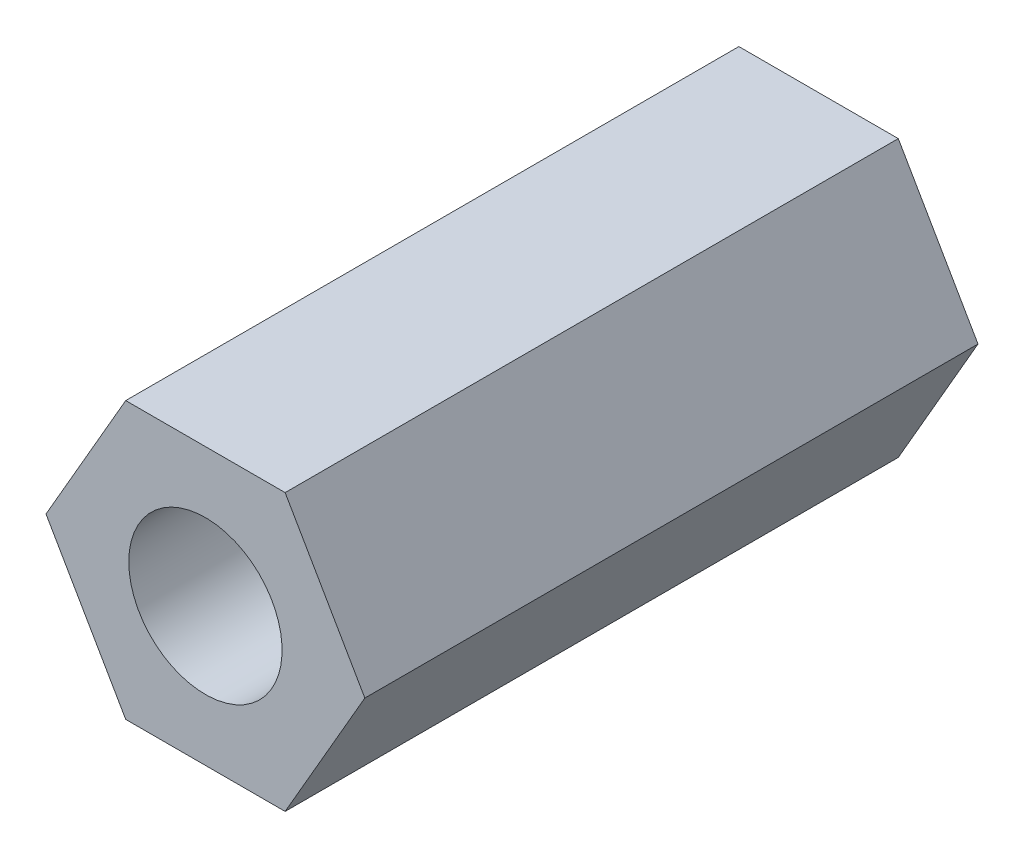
from build123d import *

# Parameters (mm, degrees)
EXTRUDE_1_DEPTH    = 10
HOLE_WIZARD_M3_1_D = 2.5


with BuildPart() as part:
    # Sketch 1 → Extrude 1 (new body)
    with BuildSketch(Plane.XY):
        Polygon((2.6, 0), (1.3, 2.25166605), (-1.3, 2.25166605), (-2.6, 0), (-1.3, -2.25166605), (1.3, -2.25166605), align=None)
    extrude(amount=EXTRUDE_1_DEPTH)

    # Hole Wizard M3 _1 (through all)
    with Locations(Plane(origin=(0, 0, 0), x_dir=(-1, 0, 0), z_dir=(0, 0, -1))):
        with Locations((0, 0)):
            Hole(HOLE_WIZARD_M3_1_D / 2)


solid = part.part
